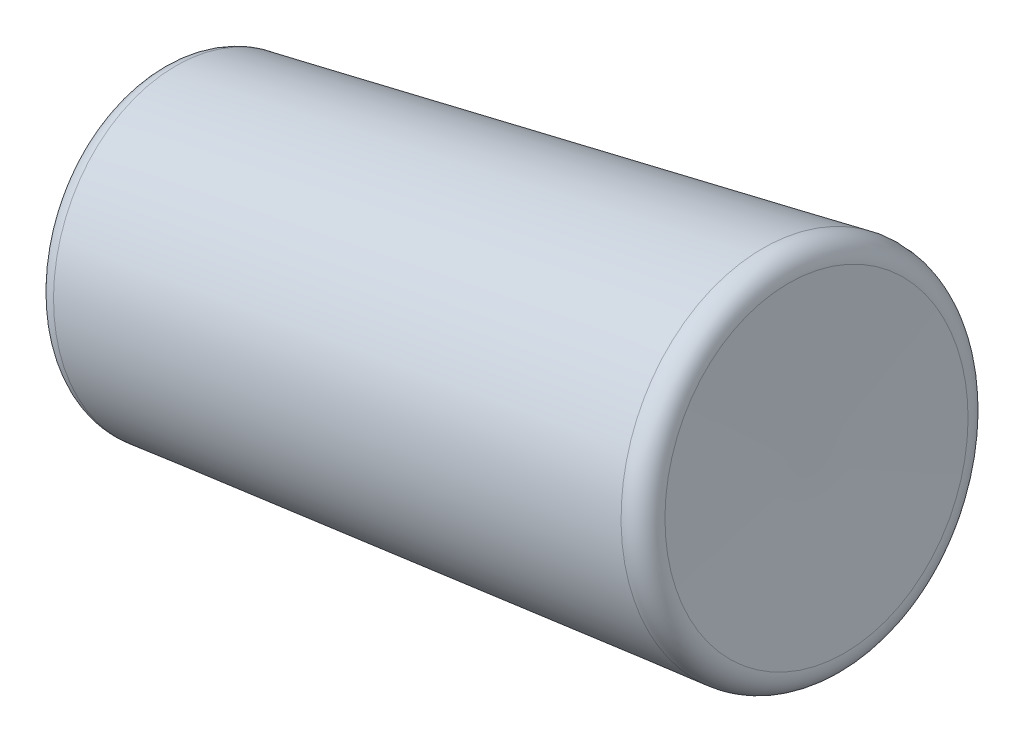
from build123d import *

# Parameters (mm, degrees)
CONG_1_R = 0.5


with BuildPart() as part:
    # Esquisse1 → Base-R_volution (revolve)
    with BuildSketch(Plane.XY, mode=Mode.PRIVATE) as base_r_volution_sk:
        Polygon((-11.546486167, 16.594489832), (3.398485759, 19.436556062), (2.795140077, 23.457029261), (-12.061608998, 20.027078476), align=None)
    revolve(base_r_volution_sk.sketch.rotate(Axis((-11.546486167, 16.594489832, 0), (0.9823940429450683, 0.18682062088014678, 0)), 180), axis=Axis((-11.546486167, 16.594489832, 0), (0.9823940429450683, 0.18682062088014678, 0)))

    # Cong_1
    cong_1_edges = [part.edges().sort_by_distance(p)[0] for p in [
        (2.795140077, 23.457029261, 0),
        (-12.061608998, 20.027078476, 0),
    ]]
    fillet(cong_1_edges, radius=CONG_1_R)


solid = part.part
